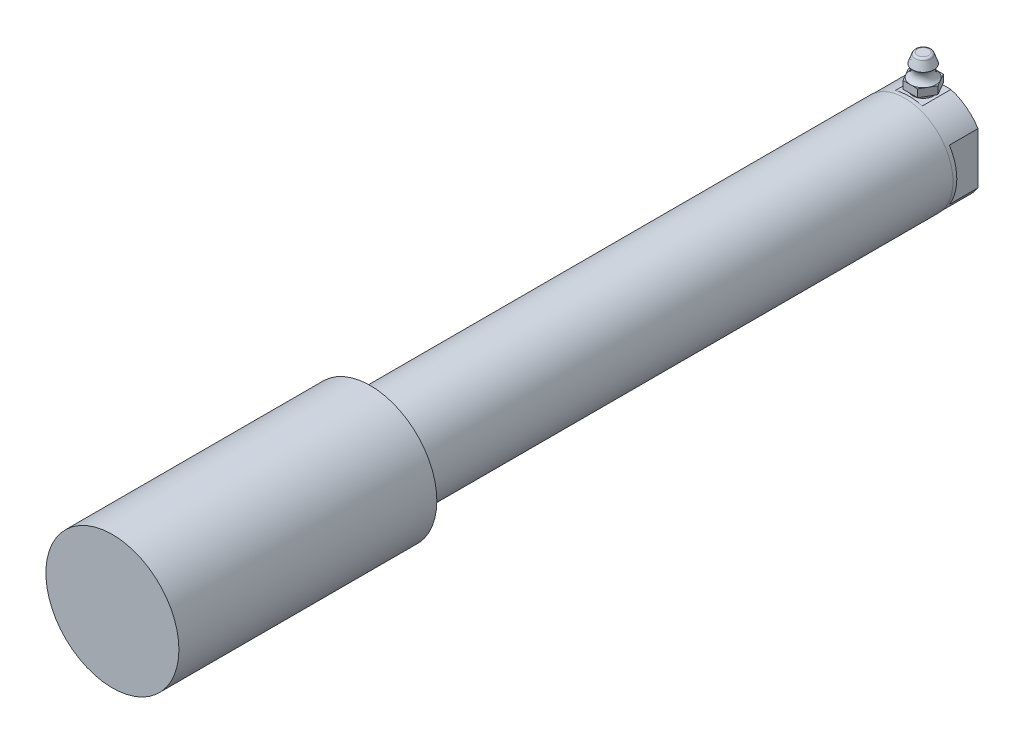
ISO-10303-21;
HEADER;
FILE_DESCRIPTION(('STEP AP214'),'2;1');
FILE_NAME('part.step','',(''),(''),'','','');
FILE_SCHEMA(('AUTOMOTIVE_DESIGN { 1 0 10303 214 1 1 1 1 }'));
ENDSEC;
DATA;
#1=APPLICATION_CONTEXT('core data for automotive mechanical design processes');
#2=APPLICATION_PROTOCOL_DEFINITION('international standard','automotive_design',2000,#1);
#3=PRODUCT_CONTEXT('',#1,'mechanical');
#4=PRODUCT('Part','Part','',(#3));
#5=PRODUCT_RELATED_PRODUCT_CATEGORY('part','',(#4));
#6=PRODUCT_DEFINITION_FORMATION('','',#4);
#7=PRODUCT_DEFINITION_CONTEXT('part definition',#1,'design');
#8=PRODUCT_DEFINITION('design','',#6,#7);
#9=PRODUCT_DEFINITION_SHAPE('','',#8);
#10=(LENGTH_UNIT() NAMED_UNIT(*) SI_UNIT(.MILLI.,.METRE.));
#11=(NAMED_UNIT(*) PLANE_ANGLE_UNIT() SI_UNIT($,.RADIAN.));
#12=(NAMED_UNIT(*) SI_UNIT($,.STERADIAN.) SOLID_ANGLE_UNIT());
#13=UNCERTAINTY_MEASURE_WITH_UNIT(LENGTH_MEASURE(1.E-05),#10,'distance_accuracy_value','');
#14=(GEOMETRIC_REPRESENTATION_CONTEXT(3) GLOBAL_UNCERTAINTY_ASSIGNED_CONTEXT((#13)) GLOBAL_UNIT_ASSIGNED_CONTEXT((#10,
#11,#12)) REPRESENTATION_CONTEXT('',''));
#15=CARTESIAN_POINT('',(0.,0.,0.));
#16=DIRECTION('',(0.,0.,1.));
#17=DIRECTION('',(1.,0.,0.));
#18=AXIS2_PLACEMENT_3D('',#15,#16,#17);
#19=CARTESIAN_POINT('',(0.,7.62,26.67));
#20=DIRECTION('',(0.,0.,-1.));
#21=DIRECTION('',(0.,1.,0.));
#22=AXIS2_PLACEMENT_3D('',#19,#20,#21);
#23=CYLINDRICAL_SURFACE('',#22,0.79375);
#24=CARTESIAN_POINT('',(0.,7.62,0.));
#25=DIRECTION('',(0.,0.,1.));
#26=DIRECTION('',(0.,-1.,0.));
#27=AXIS2_PLACEMENT_3D('',#24,#25,#26);
#28=CIRCLE('',#27,0.79375);
#29=CARTESIAN_POINT('',(0.,6.82625,0.));
#30=VERTEX_POINT('',#29);
#31=EDGE_CURVE('E205',#30,#30,#28,.T.);
#32=ORIENTED_EDGE('',*,*,#31,.F.);
#33=EDGE_LOOP('',(#32));
#34=FACE_BOUND('',#33,.T.);
#35=CARTESIAN_POINT('',(0.,7.62,0.619667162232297));
#36=DIRECTION('',(0.,0.,1.));
#37=DIRECTION('',(1.,0.,0.));
#38=AXIS2_PLACEMENT_3D('',#35,#36,#37);
#39=CIRCLE('',#38,0.79375);
#40=CARTESIAN_POINT('',(0.793749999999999,7.62,0.619667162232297));
#41=VERTEX_POINT('',#40);
#42=EDGE_CURVE('E10',#41,#41,#39,.F.);
#43=ORIENTED_EDGE('',*,*,#42,.F.);
#44=EDGE_LOOP('',(#43));
#45=FACE_BOUND('',#44,.T.);
#46=ADVANCED_FACE('F17',(#34,#45),#23,.F.);
#47=CARTESIAN_POINT('',(0.,0.,0.));
#48=DIRECTION('',(0.,0.,-1.));
#49=DIRECTION('',(0.,1.,0.));
#50=AXIS2_PLACEMENT_3D('',#47,#48,#49);
#51=CYLINDRICAL_SURFACE('',#50,4.96062);
#52=CARTESIAN_POINT('',(0.,0.,29.21));
#53=DIRECTION('',(0.,0.,-1.));
#54=DIRECTION('',(0.,1.,0.));
#55=AXIS2_PLACEMENT_3D('',#52,#53,#54);
#56=CIRCLE('',#55,4.96062);
#57=CARTESIAN_POINT('',(0.,4.96062,29.21));
#58=VERTEX_POINT('',#57);
#59=EDGE_CURVE('E191',#58,#58,#56,.T.);
#60=ORIENTED_EDGE('',*,*,#59,.F.);
#61=EDGE_LOOP('',(#60));
#62=FACE_BOUND('',#61,.T.);
#63=CARTESIAN_POINT('',(0.,0.,0.));
#64=DIRECTION('',(0.,0.,-1.));
#65=DIRECTION('',(0.,1.,0.));
#66=AXIS2_PLACEMENT_3D('',#63,#64,#65);
#67=CIRCLE('',#66,4.96062);
#68=CARTESIAN_POINT('',(0.,4.96062,0.));
#69=VERTEX_POINT('',#68);
#70=EDGE_CURVE('E185',#69,#69,#67,.T.);
#71=ORIENTED_EDGE('',*,*,#70,.T.);
#72=EDGE_LOOP('',(#71));
#73=FACE_BOUND('',#72,.T.);
#74=ADVANCED_FACE('F402',(#62,#73),#51,.F.);
#75=CARTESIAN_POINT('',(0.,0.,29.21));
#76=DIRECTION('',(0.,0.,-1.));
#77=DIRECTION('',(0.,1.,0.));
#78=AXIS2_PLACEMENT_3D('',#75,#76,#77);
#79=CONICAL_SURFACE('',#78,4.96062,1.02974425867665);
#80=CARTESIAN_POINT('',(0.,0.,32.1906412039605));
#81=VERTEX_POINT('',#80);
#82=VERTEX_LOOP('',#81);
#83=FACE_BOUND('',#82,.T.);
#84=ORIENTED_EDGE('',*,*,#59,.T.);
#85=EDGE_LOOP('',(#84));
#86=FACE_BOUND('',#85,.T.);
#87=ADVANCED_FACE('F410',(#83,#86),#79,.F.);
#88=CARTESIAN_POINT('',(0.,0.,255.999400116));
#89=DIRECTION('',(0.,0.,1.));
#90=DIRECTION('',(1.,0.,0.));
#91=AXIS2_PLACEMENT_3D('',#88,#89,#90);
#92=PLANE('',#91);
#93=CARTESIAN_POINT('',(0.,0.,255.999400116));
#94=DIRECTION('',(0.,0.,1.));
#95=DIRECTION('',(1.,0.,0.));
#96=AXIS2_PLACEMENT_3D('',#93,#94,#95);
#97=CIRCLE('',#96,20.6375);
#98=CARTESIAN_POINT('',(20.6375,0.,255.999400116));
#99=VERTEX_POINT('',#98);
#100=EDGE_CURVE('E227',#99,#99,#97,.T.);
#101=ORIENTED_EDGE('',*,*,#100,.T.);
#102=EDGE_LOOP('',(#101));
#103=FACE_BOUND('',#102,.T.);
#104=ADVANCED_FACE('F444',(#103),#92,.T.);
#105=CARTESIAN_POINT('',(0.,0.,255.999400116));
#106=DIRECTION('',(0.,0.,-1.));
#107=DIRECTION('',(-1.,0.,0.));
#108=AXIS2_PLACEMENT_3D('',#105,#106,#107);
#109=CYLINDRICAL_SURFACE('',#108,20.6375);
#110=ORIENTED_EDGE('',*,*,#100,.F.);
#111=EDGE_LOOP('',(#110));
#112=FACE_BOUND('',#111,.T.);
#113=CARTESIAN_POINT('',(0.,0.,175.9712));
#114=DIRECTION('',(0.,0.,1.));
#115=DIRECTION('',(1.,0.,0.));
#116=AXIS2_PLACEMENT_3D('',#113,#114,#115);
#117=CIRCLE('',#116,20.6375);
#118=CARTESIAN_POINT('',(20.6375,0.,175.9712));
#119=VERTEX_POINT('',#118);
#120=EDGE_CURVE('E231',#119,#119,#117,.T.);
#121=ORIENTED_EDGE('',*,*,#120,.T.);
#122=EDGE_LOOP('',(#121));
#123=FACE_BOUND('',#122,.T.);
#124=ADVANCED_FACE('F438',(#112,#123),#109,.T.);
#125=CARTESIAN_POINT('',(0.,0.,175.9712));
#126=DIRECTION('',(0.,0.,1.));
#127=DIRECTION('',(1.,0.,0.));
#128=AXIS2_PLACEMENT_3D('',#125,#126,#127);
#129=PLANE('',#128);
#130=CARTESIAN_POINT('',(0.,0.,175.9712));
#131=DIRECTION('',(0.,0.,1.));
#132=DIRECTION('',(1.,0.,0.));
#133=AXIS2_PLACEMENT_3D('',#130,#131,#132);
#134=CIRCLE('',#133,14.97203);
#135=CARTESIAN_POINT('',(14.97203,0.,175.9712));
#136=VERTEX_POINT('',#135);
#137=EDGE_CURVE('E230',#136,#136,#134,.F.);
#138=ORIENTED_EDGE('',*,*,#137,.F.);
#139=EDGE_LOOP('',(#138));
#140=FACE_BOUND('',#139,.T.);
#141=ORIENTED_EDGE('',*,*,#120,.F.);
#142=EDGE_LOOP('',(#141));
#143=FACE_BOUND('',#142,.T.);
#144=ADVANCED_FACE('F428',(#140,#143),#129,.F.);
#145=CARTESIAN_POINT('',(0.,0.,175.9712));
#146=DIRECTION('',(0.,0.,-1.));
#147=DIRECTION('',(-1.,0.,0.));
#148=AXIS2_PLACEMENT_3D('',#145,#146,#147);
#149=CYLINDRICAL_SURFACE('',#148,14.97203);
#150=CARTESIAN_POINT('',(0.,0.,10.16));
#151=DIRECTION('',(0.,0.,-1.));
#152=DIRECTION('',(-1.,0.,0.));
#153=AXIS2_PLACEMENT_3D('',#150,#151,#152);
#154=CIRCLE('',#153,14.97203);
#155=CARTESIAN_POINT('',(-14.97203,0.,10.16));
#156=VERTEX_POINT('',#155);
#157=EDGE_CURVE('E208',#156,#156,#154,.T.);
#158=ORIENTED_EDGE('',*,*,#157,.F.);
#159=EDGE_LOOP('',(#158));
#160=FACE_BOUND('',#159,.T.);
#161=ORIENTED_EDGE('',*,*,#137,.T.);
#162=EDGE_LOOP('',(#161));
#163=FACE_BOUND('',#162,.T.);
#164=ADVANCED_FACE('F425',(#160,#163),#149,.T.);
#165=CARTESIAN_POINT('',(0.,0.,10.16));
#166=DIRECTION('',(0.,0.,-1.));
#167=DIRECTION('',(-1.,0.,0.));
#168=AXIS2_PLACEMENT_3D('',#165,#166,#167);
#169=PLANE('',#168);
#170=ORIENTED_EDGE('',*,*,#157,.T.);
#171=EDGE_LOOP('',(#170));
#172=FACE_BOUND('',#171,.T.);
#173=CARTESIAN_POINT('',(0.,0.,10.16));
#174=DIRECTION('',(0.,0.,1.));
#175=DIRECTION('',(0.,-1.,0.));
#176=AXIS2_PLACEMENT_3D('',#173,#174,#175);
#177=CIRCLE('',#176,14.8844);
#178=CARTESIAN_POINT('',(0.,-14.8844,10.16));
#179=VERTEX_POINT('',#178);
#180=EDGE_CURVE('E150',#179,#179,#177,.T.);
#181=ORIENTED_EDGE('',*,*,#180,.T.);
#182=EDGE_LOOP('',(#181));
#183=FACE_BOUND('',#182,.T.);
#184=ADVANCED_FACE('F405',(#172,#183),#169,.T.);
#185=CARTESIAN_POINT('',(-1.14585258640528E-13,24.4475,4.44500000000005));
#186=DIRECTION('',(0.,1.,0.));
#187=DIRECTION('',(0.,0.,1.));
#188=AXIS2_PLACEMENT_3D('',#185,#186,#187);
#189=PLANE('',#188);
#190=CARTESIAN_POINT('',(-1.14585258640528E-13,24.4475,4.44500000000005));
#191=DIRECTION('',(0.,1.,0.));
#192=DIRECTION('',(0.,0.,1.));
#193=AXIS2_PLACEMENT_3D('',#190,#191,#192);
#194=CIRCLE('',#193,1.7474960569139);
#195=CARTESIAN_POINT('',(-1.14585258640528E-13,24.4475,6.19249605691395));
#196=VERTEX_POINT('',#195);
#197=EDGE_CURVE('E234',#196,#196,#194,.T.);
#198=ORIENTED_EDGE('',*,*,#197,.T.);
#199=EDGE_LOOP('',(#198));
#200=FACE_BOUND('',#199,.T.);
#201=ADVANCED_FACE('F307',(#200),#189,.T.);
#202=CARTESIAN_POINT('',(-1.14559021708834E-13,23.6855,4.44500000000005));
#203=DIRECTION('',(0.,1.,0.));
#204=DIRECTION('',(0.,0.,1.));
#205=AXIS2_PLACEMENT_3D('',#202,#203,#204);
#206=TOROIDAL_SURFACE('',#205,1.7474960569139,0.762);
#207=ORIENTED_EDGE('',*,*,#197,.F.);
#208=EDGE_LOOP('',(#207));
#209=FACE_BOUND('',#208,.T.);
#210=CARTESIAN_POINT('',(-1.14567780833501E-13,23.9398915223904,4.44500000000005));
#211=DIRECTION('',(0.,1.,0.));
#212=DIRECTION('',(0.,0.,1.));
#213=AXIS2_PLACEMENT_3D('',#210,#211,#212);
#214=CIRCLE('',#213,2.46577800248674);
#215=CARTESIAN_POINT('',(-1.14567780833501E-13,23.9398915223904,6.9107780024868));
#216=VERTEX_POINT('',#215);
#217=EDGE_CURVE('E302',#216,#216,#214,.F.);
#218=ORIENTED_EDGE('',*,*,#217,.F.);
#219=EDGE_LOOP('',(#218));
#220=FACE_BOUND('',#219,.T.);
#221=ADVANCED_FACE('F19',(#209,#220),#206,.T.);
#222=CARTESIAN_POINT('',(-1.14480310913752E-13,21.3995,4.44500000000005));
#223=DIRECTION('',(0.,-1.,0.));
#224=DIRECTION('',(0.,0.,-1.));
#225=AXIS2_PLACEMENT_3D('',#222,#223,#224);
#226=CONICAL_SURFACE('',#225,3.3655,0.340381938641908);
#227=ORIENTED_EDGE('',*,*,#217,.T.);
#228=EDGE_LOOP('',(#227));
#229=FACE_BOUND('',#228,.T.);
#230=CARTESIAN_POINT('',(-1.14480310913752E-13,21.3995,4.44500000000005));
#231=DIRECTION('',(0.,-1.,0.));
#232=DIRECTION('',(0.,0.,-1.));
#233=AXIS2_PLACEMENT_3D('',#230,#231,#232);
#234=CIRCLE('',#233,3.3655);
#235=CARTESIAN_POINT('',(-1.14480310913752E-13,21.3995,1.07950000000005));
#236=VERTEX_POINT('',#235);
#237=EDGE_CURVE('E239',#236,#236,#234,.T.);
#238=ORIENTED_EDGE('',*,*,#237,.F.);
#239=EDGE_LOOP('',(#238));
#240=FACE_BOUND('',#239,.T.);
#241=ADVANCED_FACE('F311',(#229,#240),#226,.T.);
#242=CARTESIAN_POINT('',(-1.14425278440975E-13,19.8011902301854,4.44500000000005));
#243=DIRECTION('',(0.,-1.,0.));
#244=DIRECTION('',(0.,0.,-1.));
#245=AXIS2_PLACEMENT_3D('',#242,#243,#244);
#246=TOROIDAL_SURFACE('',#245,5.20693450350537,2.43833450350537);
#247=ORIENTED_EDGE('',*,*,#237,.T.);
#248=EDGE_LOOP('',(#247));
#249=FACE_BOUND('',#248,.T.);
#250=CARTESIAN_POINT('',(-1.14352952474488E-13,17.700625,4.44500000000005));
#251=DIRECTION('',(0.,-1.,0.));
#252=DIRECTION('',(0.,0.,-1.));
#253=AXIS2_PLACEMENT_3D('',#250,#251,#252);
#254=CIRCLE('',#253,3.96875);
#255=CARTESIAN_POINT('',(-1.14352952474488E-13,17.700625,0.476250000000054));
#256=VERTEX_POINT('',#255);
#257=CARTESIAN_POINT('',(3.43703832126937,17.700625,2.46062500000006));
#258=VERTEX_POINT('',#257);
#259=EDGE_CURVE('E103',#256,#258,#254,.T.);
#260=ORIENTED_EDGE('',*,*,#259,.F.);
#261=CARTESIAN_POINT('',(-3.4370383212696,17.700625,2.46062500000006));
#262=VERTEX_POINT('',#261);
#263=EDGE_CURVE('E242',#262,#256,#254,.T.);
#264=ORIENTED_EDGE('',*,*,#263,.F.);
#265=CARTESIAN_POINT('',(-3.4370383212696,17.700625,6.429375));
#266=VERTEX_POINT('',#265);
#267=EDGE_CURVE('E333',#266,#262,#254,.T.);
#268=ORIENTED_EDGE('',*,*,#267,.F.);
#269=CARTESIAN_POINT('',(-1.1360179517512E-13,17.700625,8.41375));
#270=VERTEX_POINT('',#269);
#271=EDGE_CURVE('E329',#270,#266,#254,.T.);
#272=ORIENTED_EDGE('',*,*,#271,.F.);
#273=CARTESIAN_POINT('',(3.43703832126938,17.700625,6.429375));
#274=VERTEX_POINT('',#273);
#275=EDGE_CURVE('E328',#274,#270,#254,.T.);
#276=ORIENTED_EDGE('',*,*,#275,.F.);
#277=EDGE_CURVE('E96',#258,#274,#254,.T.);
#278=ORIENTED_EDGE('',*,*,#277,.F.);
#279=EDGE_LOOP('',(#260,#264,#268,#272,#276,#278));
#280=FACE_BOUND('',#279,.T.);
#281=ADVANCED_FACE('F316',(#249,#280),#246,.F.);
#282=CARTESIAN_POINT('',(-2.29135888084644,17.700625,0.476250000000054));
#283=DIRECTION('',(0.,1.,0.));
#284=DIRECTION('',(1.,0.,0.));
#285=AXIS2_PLACEMENT_3D('',#282,#283,#284);
#286=PLANE('',#285);
#287=ORIENTED_EDGE('',*,*,#267,.T.);
#288=DIRECTION('',(-0.5,0.,0.866025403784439));
#289=VECTOR('',#288,1.);
#290=CARTESIAN_POINT('',(-2.29135888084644,17.700625,0.476250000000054));
#291=LINE('',#290,#289);
#292=CARTESIAN_POINT('',(-4.58271776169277,17.700625,4.44500000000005));
#293=VERTEX_POINT('',#292);
#294=EDGE_CURVE('E253',#262,#293,#291,.T.);
#295=ORIENTED_EDGE('',*,*,#294,.T.);
#296=DIRECTION('',(0.5,0.,0.866025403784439));
#297=VECTOR('',#296,1.);
#298=CARTESIAN_POINT('',(-4.58271776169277,17.700625,4.44500000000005));
#299=LINE('',#298,#297);
#300=EDGE_CURVE('E259',#293,#266,#299,.T.);
#301=ORIENTED_EDGE('',*,*,#300,.T.);
#302=EDGE_LOOP('',(#287,#295,#301));
#303=FACE_BOUND('',#302,.T.);
#304=ADVANCED_FACE('F322',(#303),#286,.T.);
#305=ORIENTED_EDGE('',*,*,#271,.T.);
#306=CARTESIAN_POINT('',(-2.29135888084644,17.700625,8.41375));
#307=VERTEX_POINT('',#306);
#308=EDGE_CURVE('E258',#266,#307,#299,.T.);
#309=ORIENTED_EDGE('',*,*,#308,.T.);
#310=DIRECTION('',(1.,0.,0.));
#311=VECTOR('',#310,1.);
#312=CARTESIAN_POINT('',(-2.29135888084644,17.700625,8.41375));
#313=LINE('',#312,#311);
#314=EDGE_CURVE('E262',#307,#270,#313,.T.);
#315=ORIENTED_EDGE('',*,*,#314,.T.);
#316=EDGE_LOOP('',(#305,#309,#315));
#317=FACE_BOUND('',#316,.T.);
#318=ADVANCED_FACE('F366',(#317),#286,.T.);
#319=ORIENTED_EDGE('',*,*,#275,.T.);
#320=CARTESIAN_POINT('',(2.29135888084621,17.700625,8.41375));
#321=VERTEX_POINT('',#320);
#322=EDGE_CURVE('E261',#270,#321,#313,.T.);
#323=ORIENTED_EDGE('',*,*,#322,.T.);
#324=DIRECTION('',(0.5,0.,-0.866025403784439));
#325=VECTOR('',#324,1.);
#326=CARTESIAN_POINT('',(2.29135888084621,17.700625,8.41375));
#327=LINE('',#326,#325);
#328=EDGE_CURVE('E266',#321,#274,#327,.T.);
#329=ORIENTED_EDGE('',*,*,#328,.T.);
#330=EDGE_LOOP('',(#319,#323,#329));
#331=FACE_BOUND('',#330,.T.);
#332=ADVANCED_FACE('F371',(#331),#286,.T.);
#333=ORIENTED_EDGE('',*,*,#277,.T.);
#334=CARTESIAN_POINT('',(4.58271776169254,17.700625,4.44500000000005));
#335=VERTEX_POINT('',#334);
#336=EDGE_CURVE('E265',#274,#335,#327,.T.);
#337=ORIENTED_EDGE('',*,*,#336,.T.);
#338=DIRECTION('',(-0.5,0.,-0.866025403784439));
#339=VECTOR('',#338,1.);
#340=CARTESIAN_POINT('',(4.58271776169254,17.700625,4.44500000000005));
#341=LINE('',#340,#339);
#342=EDGE_CURVE('E270',#335,#258,#341,.T.);
#343=ORIENTED_EDGE('',*,*,#342,.T.);
#344=EDGE_LOOP('',(#333,#337,#343));
#345=FACE_BOUND('',#344,.T.);
#346=ADVANCED_FACE('F375',(#345),#286,.T.);
#347=ORIENTED_EDGE('',*,*,#259,.T.);
#348=CARTESIAN_POINT('',(2.29135888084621,17.700625,0.476250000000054));
#349=VERTEX_POINT('',#348);
#350=EDGE_CURVE('E269',#258,#349,#341,.T.);
#351=ORIENTED_EDGE('',*,*,#350,.T.);
#352=DIRECTION('',(-1.,0.,0.));
#353=VECTOR('',#352,1.);
#354=CARTESIAN_POINT('',(2.29135888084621,17.700625,0.476250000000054));
#355=LINE('',#354,#353);
#356=EDGE_CURVE('E251',#349,#256,#355,.T.);
#357=ORIENTED_EDGE('',*,*,#356,.T.);
#358=EDGE_LOOP('',(#347,#351,#357));
#359=FACE_BOUND('',#358,.T.);
#360=ADVANCED_FACE('F345',(#359),#286,.T.);
#361=ORIENTED_EDGE('',*,*,#263,.T.);
#362=CARTESIAN_POINT('',(-2.29135888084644,17.700625,0.476250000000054));
#363=VERTEX_POINT('',#362);
#364=EDGE_CURVE('E254',#256,#363,#355,.T.);
#365=ORIENTED_EDGE('',*,*,#364,.T.);
#366=EDGE_CURVE('E255',#363,#262,#291,.T.);
#367=ORIENTED_EDGE('',*,*,#366,.T.);
#368=EDGE_LOOP('',(#361,#365,#367));
#369=FACE_BOUND('',#368,.T.);
#370=ADVANCED_FACE('F339',(#369),#286,.T.);
#371=CARTESIAN_POINT('',(-2.29135888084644,17.700625,0.476250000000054));
#372=DIRECTION('',(0.866025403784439,0.,0.5));
#373=DIRECTION('',(0.5,0.,-0.866025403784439));
#374=AXIS2_PLACEMENT_3D('',#371,#372,#373);
#375=PLANE('',#374);
#376=DIRECTION('',(-0.5,0.,0.866025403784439));
#377=VECTOR('',#376,1.);
#378=CARTESIAN_POINT('',(-2.29135888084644,15.319375,0.476250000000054));
#379=LINE('',#378,#377);
#380=CARTESIAN_POINT('',(-2.29135888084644,15.319375,0.476250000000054));
#381=VERTEX_POINT('',#380);
#382=CARTESIAN_POINT('',(-4.58271776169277,15.319375,4.44500000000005));
#383=VERTEX_POINT('',#382);
#384=EDGE_CURVE('E275',#381,#383,#379,.T.);
#385=ORIENTED_EDGE('',*,*,#384,.T.);
#386=DIRECTION('',(0.,-1.,0.));
#387=VECTOR('',#386,1.);
#388=CARTESIAN_POINT('',(-4.58271776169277,17.700625,4.44500000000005));
#389=LINE('',#388,#387);
#390=EDGE_CURVE('E296',#293,#383,#389,.T.);
#391=ORIENTED_EDGE('',*,*,#390,.F.);
#392=ORIENTED_EDGE('',*,*,#294,.F.);
#393=ORIENTED_EDGE('',*,*,#366,.F.);
#394=DIRECTION('',(0.,-1.,0.));
#395=VECTOR('',#394,1.);
#396=CARTESIAN_POINT('',(-2.29135888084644,17.700625,0.476250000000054));
#397=LINE('',#396,#395);
#398=EDGE_CURVE('E299',#363,#381,#397,.T.);
#399=ORIENTED_EDGE('',*,*,#398,.T.);
#400=EDGE_LOOP('',(#385,#391,#392,#393,#399));
#401=FACE_BOUND('',#400,.T.);
#402=ADVANCED_FACE('F359',(#401),#375,.F.);
#403=CARTESIAN_POINT('',(-4.58271776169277,17.700625,4.44500000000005));
#404=DIRECTION('',(0.866025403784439,0.,-0.5));
#405=DIRECTION('',(-0.5,0.,-0.866025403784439));
#406=AXIS2_PLACEMENT_3D('',#403,#404,#405);
#407=PLANE('',#406);
#408=DIRECTION('',(0.5,0.,0.866025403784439));
#409=VECTOR('',#408,1.);
#410=CARTESIAN_POINT('',(-4.58271776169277,15.319375,4.44500000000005));
#411=LINE('',#410,#409);
#412=CARTESIAN_POINT('',(-2.29135888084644,15.319375,8.41375));
#413=VERTEX_POINT('',#412);
#414=EDGE_CURVE('E277',#383,#413,#411,.T.);
#415=ORIENTED_EDGE('',*,*,#414,.T.);
#416=DIRECTION('',(0.,-1.,0.));
#417=VECTOR('',#416,1.);
#418=CARTESIAN_POINT('',(-2.29135888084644,17.700625,8.41375));
#419=LINE('',#418,#417);
#420=EDGE_CURVE('E293',#307,#413,#419,.T.);
#421=ORIENTED_EDGE('',*,*,#420,.F.);
#422=ORIENTED_EDGE('',*,*,#308,.F.);
#423=ORIENTED_EDGE('',*,*,#300,.F.);
#424=ORIENTED_EDGE('',*,*,#390,.T.);
#425=EDGE_LOOP('',(#415,#421,#422,#423,#424));
#426=FACE_BOUND('',#425,.T.);
#427=ADVANCED_FACE('F364',(#426),#407,.F.);
#428=CARTESIAN_POINT('',(-2.29135888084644,17.700625,8.41375));
#429=DIRECTION('',(0.,0.,-1.));
#430=DIRECTION('',(-1.,0.,0.));
#431=AXIS2_PLACEMENT_3D('',#428,#429,#430);
#432=PLANE('',#431);
#433=DIRECTION('',(1.,0.,0.));
#434=VECTOR('',#433,1.);
#435=CARTESIAN_POINT('',(-2.29135888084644,15.319375,8.41375));
#436=LINE('',#435,#434);
#437=CARTESIAN_POINT('',(2.29135888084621,15.319375,8.41375));
#438=VERTEX_POINT('',#437);
#439=EDGE_CURVE('E279',#413,#438,#436,.T.);
#440=ORIENTED_EDGE('',*,*,#439,.T.);
#441=DIRECTION('',(0.,-1.,0.));
#442=VECTOR('',#441,1.);
#443=CARTESIAN_POINT('',(2.29135888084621,17.700625,8.41375));
#444=LINE('',#443,#442);
#445=EDGE_CURVE('E290',#321,#438,#444,.T.);
#446=ORIENTED_EDGE('',*,*,#445,.F.);
#447=ORIENTED_EDGE('',*,*,#322,.F.);
#448=ORIENTED_EDGE('',*,*,#314,.F.);
#449=ORIENTED_EDGE('',*,*,#420,.T.);
#450=EDGE_LOOP('',(#440,#446,#447,#448,#449));
#451=FACE_BOUND('',#450,.T.);
#452=ADVANCED_FACE('F368',(#451),#432,.F.);
#453=CARTESIAN_POINT('',(2.29135888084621,17.700625,8.41375));
#454=DIRECTION('',(-0.866025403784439,0.,-0.5));
#455=DIRECTION('',(-0.5,0.,0.866025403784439));
#456=AXIS2_PLACEMENT_3D('',#453,#454,#455);
#457=PLANE('',#456);
#458=DIRECTION('',(0.5,0.,-0.866025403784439));
#459=VECTOR('',#458,1.);
#460=CARTESIAN_POINT('',(2.29135888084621,15.319375,8.41375));
#461=LINE('',#460,#459);
#462=CARTESIAN_POINT('',(4.58271776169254,15.319375,4.44500000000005));
#463=VERTEX_POINT('',#462);
#464=EDGE_CURVE('E281',#438,#463,#461,.T.);
#465=ORIENTED_EDGE('',*,*,#464,.T.);
#466=DIRECTION('',(0.,-1.,0.));
#467=VECTOR('',#466,1.);
#468=CARTESIAN_POINT('',(4.58271776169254,17.700625,4.44500000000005));
#469=LINE('',#468,#467);
#470=EDGE_CURVE('E287',#335,#463,#469,.T.);
#471=ORIENTED_EDGE('',*,*,#470,.F.);
#472=ORIENTED_EDGE('',*,*,#336,.F.);
#473=ORIENTED_EDGE('',*,*,#328,.F.);
#474=ORIENTED_EDGE('',*,*,#445,.T.);
#475=EDGE_LOOP('',(#465,#471,#472,#473,#474));
#476=FACE_BOUND('',#475,.T.);
#477=ADVANCED_FACE('F373',(#476),#457,.F.);
#478=CARTESIAN_POINT('',(4.58271776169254,17.700625,4.44500000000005));
#479=DIRECTION('',(-0.866025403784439,0.,0.5));
#480=DIRECTION('',(0.5,0.,0.866025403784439));
#481=AXIS2_PLACEMENT_3D('',#478,#479,#480);
#482=PLANE('',#481);
#483=DIRECTION('',(-0.5,0.,-0.866025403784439));
#484=VECTOR('',#483,1.);
#485=CARTESIAN_POINT('',(4.58271776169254,15.319375,4.44500000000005));
#486=LINE('',#485,#484);
#487=CARTESIAN_POINT('',(2.29135888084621,15.319375,0.476250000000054));
#488=VERTEX_POINT('',#487);
#489=EDGE_CURVE('E283',#463,#488,#486,.T.);
#490=ORIENTED_EDGE('',*,*,#489,.T.);
#491=DIRECTION('',(0.,-1.,0.));
#492=VECTOR('',#491,1.);
#493=CARTESIAN_POINT('',(2.29135888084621,17.700625,0.476250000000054));
#494=LINE('',#493,#492);
#495=EDGE_CURVE('E272',#349,#488,#494,.T.);
#496=ORIENTED_EDGE('',*,*,#495,.F.);
#497=ORIENTED_EDGE('',*,*,#350,.F.);
#498=ORIENTED_EDGE('',*,*,#342,.F.);
#499=ORIENTED_EDGE('',*,*,#470,.T.);
#500=EDGE_LOOP('',(#490,#496,#497,#498,#499));
#501=FACE_BOUND('',#500,.T.);
#502=ADVANCED_FACE('F349',(#501),#482,.F.);
#503=CARTESIAN_POINT('',(2.29135888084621,17.700625,0.476250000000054));
#504=DIRECTION('',(0.,0.,1.));
#505=DIRECTION('',(0.,-1.,0.));
#506=AXIS2_PLACEMENT_3D('',#503,#504,#505);
#507=PLANE('',#506);
#508=DIRECTION('',(-1.,0.,0.));
#509=VECTOR('',#508,1.);
#510=CARTESIAN_POINT('',(2.29135888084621,15.319375,0.476250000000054));
#511=LINE('',#510,#509);
#512=EDGE_CURVE('E250',#488,#381,#511,.T.);
#513=ORIENTED_EDGE('',*,*,#512,.T.);
#514=ORIENTED_EDGE('',*,*,#398,.F.);
#515=ORIENTED_EDGE('',*,*,#364,.F.);
#516=ORIENTED_EDGE('',*,*,#356,.F.);
#517=ORIENTED_EDGE('',*,*,#495,.T.);
#518=EDGE_LOOP('',(#513,#514,#515,#516,#517));
#519=FACE_BOUND('',#518,.T.);
#520=ADVANCED_FACE('F344',(#519),#507,.F.);
#521=CARTESIAN_POINT('',(-2.29135888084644,15.319375,0.476250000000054));
#522=DIRECTION('',(0.,1.,0.));
#523=DIRECTION('',(1.,0.,0.));
#524=AXIS2_PLACEMENT_3D('',#521,#522,#523);
#525=PLANE('',#524);
#526=CARTESIAN_POINT('',(-1.14270962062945E-13,15.319375,4.44500000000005));
#527=DIRECTION('',(0.,-1.,0.));
#528=DIRECTION('',(0.,0.,-1.));
#529=AXIS2_PLACEMENT_3D('',#526,#527,#528);
#530=CIRCLE('',#529,3.2385);
#531=CARTESIAN_POINT('',(-1.14270962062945E-13,15.319375,1.20650000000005));
#532=VERTEX_POINT('',#531);
#533=EDGE_CURVE('E244',#532,#532,#530,.T.);
#534=ORIENTED_EDGE('',*,*,#533,.F.);
#535=EDGE_LOOP('',(#534));
#536=FACE_BOUND('',#535,.T.);
#537=ORIENTED_EDGE('',*,*,#512,.F.);
#538=ORIENTED_EDGE('',*,*,#489,.F.);
#539=ORIENTED_EDGE('',*,*,#464,.F.);
#540=ORIENTED_EDGE('',*,*,#439,.F.);
#541=ORIENTED_EDGE('',*,*,#414,.F.);
#542=ORIENTED_EDGE('',*,*,#384,.F.);
#543=EDGE_LOOP('',(#537,#538,#539,#540,#541,#542));
#544=FACE_BOUND('',#543,.T.);
#545=ADVANCED_FACE('F353',(#536,#544),#525,.F.);
#546=CARTESIAN_POINT('',(-1.14270962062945E-13,15.319375,4.44500000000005));
#547=DIRECTION('',(0.,-1.,0.));
#548=DIRECTION('',(0.,0.,-1.));
#549=AXIS2_PLACEMENT_3D('',#546,#547,#548);
#550=CYLINDRICAL_SURFACE('',#549,3.2385);
#551=ORIENTED_EDGE('',*,*,#533,.T.);
#552=EDGE_LOOP('',(#551));
#553=FACE_BOUND('',#552,.T.);
#554=CARTESIAN_POINT('',(-1.14253470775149E-13,14.811375,4.44500000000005));
#555=DIRECTION('',(0.,-1.,0.));
#556=DIRECTION('',(0.,0.,-1.));
#557=AXIS2_PLACEMENT_3D('',#554,#555,#556);
#558=CIRCLE('',#557,3.2385);
#559=CARTESIAN_POINT('',(-1.14253470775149E-13,14.811375,1.20650000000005));
#560=VERTEX_POINT('',#559);
#561=EDGE_CURVE('E247',#560,#560,#558,.T.);
#562=ORIENTED_EDGE('',*,*,#561,.F.);
#563=EDGE_LOOP('',(#562));
#564=FACE_BOUND('',#563,.T.);
#565=ADVANCED_FACE('F743',(#553,#564),#550,.T.);
#566=CARTESIAN_POINT('',(-1.14106981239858E-13,10.556875,4.44500000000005));
#567=DIRECTION('',(0.,1.,0.));
#568=DIRECTION('',(0.,0.,1.));
#569=AXIS2_PLACEMENT_3D('',#566,#567,#568);
#570=CONICAL_SURFACE('',#569,3.048,0.0447462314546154);
#571=ORIENTED_EDGE('',*,*,#561,.T.);
#572=EDGE_LOOP('',(#571));
#573=FACE_BOUND('',#572,.T.);
#574=CARTESIAN_POINT('',(-1.14210526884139E-13,14.2875,4.44500000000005));
#575=DIRECTION('',(0.,-1.,0.));
#576=DIRECTION('',(1.,0.,0.));
#577=AXIS2_PLACEMENT_3D('',#574,#575,#576);
#578=CIRCLE('',#577,3.21504291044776);
#579=CARTESIAN_POINT('',(3.21504291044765,14.2875,4.44500000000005));
#580=VERTEX_POINT('',#579);
#581=EDGE_CURVE('E218',#580,#580,#578,.T.);
#582=ORIENTED_EDGE('',*,*,#581,.F.);
#583=EDGE_LOOP('',(#582));
#584=FACE_BOUND('',#583,.T.);
#585=ADVANCED_FACE('F413',(#573,#584),#570,.T.);
#586=CARTESIAN_POINT('',(0.,0.,8.89));
#587=DIRECTION('',(0.,0.,-1.));
#588=DIRECTION('',(0.,1.,0.));
#589=AXIS2_PLACEMENT_3D('',#586,#587,#588);
#590=PLANE('',#589);
#591=DIRECTION('',(0.,-1.,0.));
#592=VECTOR('',#591,1.);
#593=CARTESIAN_POINT('',(12.573,-7.9664944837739,8.89));
#594=LINE('',#593,#592);
#595=CARTESIAN_POINT('',(12.573,7.9664944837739,8.89));
#596=VERTEX_POINT('',#595);
#597=CARTESIAN_POINT('',(12.573,-7.9664944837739,8.89));
#598=VERTEX_POINT('',#597);
#599=EDGE_CURVE('E146',#596,#598,#594,.T.);
#600=ORIENTED_EDGE('',*,*,#599,.F.);
#601=CARTESIAN_POINT('',(0.,0.,8.89));
#602=DIRECTION('',(0.,0.,-1.));
#603=DIRECTION('',(0.,1.,0.));
#604=AXIS2_PLACEMENT_3D('',#601,#602,#603);
#605=CIRCLE('',#604,14.8844);
#606=EDGE_CURVE('E169',#598,#596,#605,.F.);
#607=ORIENTED_EDGE('',*,*,#606,.F.);
#608=EDGE_LOOP('',(#600,#607));
#609=FACE_BOUND('',#608,.T.);
#610=ADVANCED_FACE('F437',(#609),#590,.T.);
#611=CARTESIAN_POINT('',(12.573,-7.9664944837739,8.89));
#612=DIRECTION('',(1.,0.,0.));
#613=DIRECTION('',(0.,0.,-1.));
#614=AXIS2_PLACEMENT_3D('',#611,#612,#613);
#615=PLANE('',#614);
#616=DIRECTION('',(0.,-1.,0.));
#617=VECTOR('',#616,1.);
#618=CARTESIAN_POINT('',(12.573,-7.9664944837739,0.));
#619=LINE('',#618,#617);
#620=CARTESIAN_POINT('',(12.573,7.9664944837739,0.));
#621=VERTEX_POINT('',#620);
#622=CARTESIAN_POINT('',(12.573,-7.9664944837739,0.));
#623=VERTEX_POINT('',#622);
#624=EDGE_CURVE('E143',#621,#623,#619,.T.);
#625=ORIENTED_EDGE('',*,*,#624,.F.);
#626=DIRECTION('',(0.,0.,-1.));
#627=VECTOR('',#626,1.);
#628=CARTESIAN_POINT('',(12.573,7.9664944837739,8.89));
#629=LINE('',#628,#627);
#630=EDGE_CURVE('E151',#596,#621,#629,.T.);
#631=ORIENTED_EDGE('',*,*,#630,.F.);
#632=ORIENTED_EDGE('',*,*,#599,.T.);
#633=DIRECTION('',(0.,0.,-1.));
#634=VECTOR('',#633,1.);
#635=CARTESIAN_POINT('',(12.573,-7.9664944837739,8.89));
#636=LINE('',#635,#634);
#637=EDGE_CURVE('E140',#598,#623,#636,.T.);
#638=ORIENTED_EDGE('',*,*,#637,.T.);
#639=EDGE_LOOP('',(#625,#631,#632,#638));
#640=FACE_BOUND('',#639,.T.);
#641=ADVANCED_FACE('F142',(#640),#615,.T.);
#642=DIRECTION('',(0.,1.,0.));
#643=VECTOR('',#642,1.);
#644=CARTESIAN_POINT('',(-12.573,-7.9664944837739,8.89));
#645=LINE('',#644,#643);
#646=CARTESIAN_POINT('',(-12.573,-7.9664944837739,8.89));
#647=VERTEX_POINT('',#646);
#648=CARTESIAN_POINT('',(-12.573,7.9664944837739,8.89));
#649=VERTEX_POINT('',#648);
#650=EDGE_CURVE('E161',#647,#649,#645,.T.);
#651=ORIENTED_EDGE('',*,*,#650,.F.);
#652=EDGE_CURVE('E172',#649,#647,#605,.F.);
#653=ORIENTED_EDGE('',*,*,#652,.F.);
#654=EDGE_LOOP('',(#651,#653));
#655=FACE_BOUND('',#654,.T.);
#656=ADVANCED_FACE('F470',(#655),#590,.T.);
#657=CARTESIAN_POINT('',(-12.573,-7.9664944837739,8.89));
#658=DIRECTION('',(-1.,0.,0.));
#659=DIRECTION('',(0.,0.,1.));
#660=AXIS2_PLACEMENT_3D('',#657,#658,#659);
#661=PLANE('',#660);
#662=DIRECTION('',(0.,1.,0.));
#663=VECTOR('',#662,1.);
#664=CARTESIAN_POINT('',(-12.573,-7.9664944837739,0.));
#665=LINE('',#664,#663);
#666=CARTESIAN_POINT('',(-12.573,-7.9664944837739,0.));
#667=VERTEX_POINT('',#666);
#668=CARTESIAN_POINT('',(-12.573,7.9664944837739,0.));
#669=VERTEX_POINT('',#668);
#670=EDGE_CURVE('E162',#667,#669,#665,.T.);
#671=ORIENTED_EDGE('',*,*,#670,.F.);
#672=DIRECTION('',(0.,0.,-1.));
#673=VECTOR('',#672,1.);
#674=CARTESIAN_POINT('',(-12.573,-7.9664944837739,8.89));
#675=LINE('',#674,#673);
#676=EDGE_CURVE('E168',#647,#667,#675,.T.);
#677=ORIENTED_EDGE('',*,*,#676,.F.);
#678=ORIENTED_EDGE('',*,*,#650,.T.);
#679=DIRECTION('',(0.,0.,-1.));
#680=VECTOR('',#679,1.);
#681=CARTESIAN_POINT('',(-12.573,7.9664944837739,8.89));
#682=LINE('',#681,#680);
#683=EDGE_CURVE('E181',#649,#669,#682,.T.);
#684=ORIENTED_EDGE('',*,*,#683,.T.);
#685=EDGE_LOOP('',(#671,#677,#678,#684));
#686=FACE_BOUND('',#685,.T.);
#687=ADVANCED_FACE('F465',(#686),#661,.T.);
#688=CARTESIAN_POINT('',(0.,0.,0.));
#689=DIRECTION('',(0.,0.,-1.));
#690=DIRECTION('',(0.,1.,0.));
#691=AXIS2_PLACEMENT_3D('',#688,#689,#690);
#692=PLANE('',#691);
#693=ORIENTED_EDGE('',*,*,#70,.F.);
#694=EDGE_LOOP('',(#693));
#695=FACE_BOUND('',#694,.T.);
#696=DIRECTION('',(-1.,0.,0.));
#697=VECTOR('',#696,1.);
#698=CARTESIAN_POINT('',(4.17285359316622,14.2875,0.));
#699=LINE('',#698,#697);
#700=CARTESIAN_POINT('',(4.17285359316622,14.2875,0.));
#701=VERTEX_POINT('',#700);
#702=CARTESIAN_POINT('',(-4.17285359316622,14.2875,0.));
#703=VERTEX_POINT('',#702);
#704=EDGE_CURVE('E108',#701,#703,#699,.T.);
#705=ORIENTED_EDGE('',*,*,#704,.F.);
#706=CARTESIAN_POINT('',(0.,0.,0.));
#707=DIRECTION('',(0.,0.,-1.));
#708=DIRECTION('',(0.,1.,0.));
#709=AXIS2_PLACEMENT_3D('',#706,#707,#708);
#710=CIRCLE('',#709,14.8844);
#711=EDGE_CURVE('E160',#701,#621,#710,.T.);
#712=ORIENTED_EDGE('',*,*,#711,.T.);
#713=ORIENTED_EDGE('',*,*,#624,.T.);
#714=EDGE_CURVE('E158',#623,#667,#710,.T.);
#715=ORIENTED_EDGE('',*,*,#714,.T.);
#716=ORIENTED_EDGE('',*,*,#670,.T.);
#717=EDGE_CURVE('E170',#669,#703,#710,.T.);
#718=ORIENTED_EDGE('',*,*,#717,.T.);
#719=EDGE_LOOP('',(#705,#712,#713,#715,#716,#718));
#720=FACE_BOUND('',#719,.T.);
#721=ORIENTED_EDGE('',*,*,#31,.T.);
#722=EDGE_LOOP('',(#721));
#723=FACE_BOUND('',#722,.T.);
#724=ADVANCED_FACE('F155',(#695,#720,#723),#692,.T.);
#725=CARTESIAN_POINT('',(-4.17285359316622,14.2875,8.89));
#726=DIRECTION('',(0.,0.,-1.));
#727=DIRECTION('',(0.,1.,0.));
#728=AXIS2_PLACEMENT_3D('',#725,#726,#727);
#729=PLANE('',#728);
#730=CARTESIAN_POINT('',(0.,0.,8.89));
#731=DIRECTION('',(0.,0.,-1.));
#732=DIRECTION('',(0.,1.,0.));
#733=AXIS2_PLACEMENT_3D('',#730,#731,#732);
#734=CIRCLE('',#733,14.8844);
#735=CARTESIAN_POINT('',(4.17285359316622,14.2875,8.89));
#736=VERTEX_POINT('',#735);
#737=CARTESIAN_POINT('',(-4.17285359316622,14.2875,8.89));
#738=VERTEX_POINT('',#737);
#739=EDGE_CURVE('E223',#736,#738,#734,.F.);
#740=ORIENTED_EDGE('',*,*,#739,.F.);
#741=DIRECTION('',(-1.,0.,0.));
#742=VECTOR('',#741,1.);
#743=CARTESIAN_POINT('',(4.17285359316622,14.2875,8.89));
#744=LINE('',#743,#742);
#745=EDGE_CURVE('E196',#736,#738,#744,.T.);
#746=ORIENTED_EDGE('',*,*,#745,.T.);
#747=EDGE_LOOP('',(#740,#746));
#748=FACE_BOUND('',#747,.T.);
#749=ADVANCED_FACE('F464',(#748),#729,.T.);
#750=CARTESIAN_POINT('',(4.17285359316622,14.2875,8.89));
#751=DIRECTION('',(0.,-1.,0.));
#752=DIRECTION('',(0.,0.,-1.));
#753=AXIS2_PLACEMENT_3D('',#750,#751,#752);
#754=PLANE('',#753);
#755=ORIENTED_EDGE('',*,*,#581,.T.);
#756=EDGE_LOOP('',(#755));
#757=FACE_BOUND('',#756,.T.);
#758=ORIENTED_EDGE('',*,*,#704,.T.);
#759=DIRECTION('',(0.,0.,-1.));
#760=VECTOR('',#759,1.);
#761=CARTESIAN_POINT('',(-4.17285359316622,14.2875,8.89));
#762=LINE('',#761,#760);
#763=EDGE_CURVE('E194',#738,#703,#762,.T.);
#764=ORIENTED_EDGE('',*,*,#763,.F.);
#765=ORIENTED_EDGE('',*,*,#745,.F.);
#766=DIRECTION('',(0.,0.,-1.));
#767=VECTOR('',#766,1.);
#768=CARTESIAN_POINT('',(4.17285359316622,14.2875,8.89));
#769=LINE('',#768,#767);
#770=EDGE_CURVE('E37',#736,#701,#769,.T.);
#771=ORIENTED_EDGE('',*,*,#770,.T.);
#772=EDGE_LOOP('',(#758,#764,#765,#771));
#773=FACE_BOUND('',#772,.T.);
#774=ADVANCED_FACE('F395',(#757,#773),#754,.F.);
#775=CARTESIAN_POINT('',(0.,0.,2.54));
#776=DIRECTION('',(0.,0.,-1.));
#777=DIRECTION('',(0.,1.,0.));
#778=AXIS2_PLACEMENT_3D('',#775,#776,#777);
#779=CYLINDRICAL_SURFACE('',#778,14.8844);
#780=ORIENTED_EDGE('',*,*,#770,.F.);
#781=ORIENTED_EDGE('',*,*,#739,.T.);
#782=ORIENTED_EDGE('',*,*,#763,.T.);
#783=ORIENTED_EDGE('',*,*,#717,.F.);
#784=ORIENTED_EDGE('',*,*,#683,.F.);
#785=ORIENTED_EDGE('',*,*,#652,.T.);
#786=ORIENTED_EDGE('',*,*,#676,.T.);
#787=ORIENTED_EDGE('',*,*,#714,.F.);
#788=ORIENTED_EDGE('',*,*,#637,.F.);
#789=ORIENTED_EDGE('',*,*,#606,.T.);
#790=ORIENTED_EDGE('',*,*,#630,.T.);
#791=ORIENTED_EDGE('',*,*,#711,.F.);
#792=EDGE_LOOP('',(#780,#781,#782,#783,#784,#785,#786,#787,#788,#789,#790,#791));
#793=FACE_BOUND('',#792,.T.);
#794=ORIENTED_EDGE('',*,*,#180,.F.);
#795=EDGE_LOOP('',(#794));
#796=FACE_BOUND('',#795,.T.);
#797=ADVANCED_FACE('F165',(#793,#796),#779,.T.);
#798=CARTESIAN_POINT('',(0.,7.62,0.888999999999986));
#799=DIRECTION('',(0.,1.,0.));
#800=DIRECTION('',(1.,0.,0.));
#801=AXIS2_PLACEMENT_3D('',#798,#799,#800);
#802=SPHERICAL_SURFACE('',#801,0.8382);
#803=CARTESIAN_POINT('',(0.,7.62,0.888999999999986));
#804=DIRECTION('',(0.,0.,1.));
#805=DIRECTION('',(1.,0.,0.));
#806=AXIS2_PLACEMENT_3D('',#803,#804,#805);
#807=SPHERICAL_SURFACE('',#806,0.8382);
#808=ORIENTED_EDGE('',*,*,#42,.T.);
#809=EDGE_LOOP('',(#808));
#810=FACE_BOUND('',#809,.T.);
#811=ADVANCED_FACE('F385',(#810),#807,.T.);
#812=CLOSED_SHELL('',(#46,#74,#87,#104,#124,#144,#164,#184,#201,#221,#241,#281,#304,#318,#332,
#346,#360,#370,#402,#427,#452,#477,#502,#520,#545,#565,#585,#610,#641,#656,#687,#724,#749,#774,
#797,#811));
#813=CARTESIAN_POINT('',(0.,7.62,0.888999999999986));
#814=DIRECTION('',(0.,0.,-1.));
#815=DIRECTION('',(-1.,0.,0.));
#816=AXIS2_PLACEMENT_3D('',#813,#814,#815);
#817=SPHERICAL_SURFACE('',#816,0.8382);
#818=CARTESIAN_POINT('',(0.,7.62,1.15833283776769));
#819=DIRECTION('',(0.,0.,-1.));
#820=DIRECTION('',(-1.,0.,0.));
#821=AXIS2_PLACEMENT_3D('',#818,#819,#820);
#822=CIRCLE('',#821,0.79375);
#823=CARTESIAN_POINT('',(-0.793750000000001,7.62,1.15833283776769));
#824=VERTEX_POINT('',#823);
#825=EDGE_CURVE('E28',#824,#824,#822,.F.);
#826=ORIENTED_EDGE('',*,*,#825,.T.);
#827=EDGE_LOOP('',(#826));
#828=FACE_BOUND('',#827,.T.);
#829=ADVANCED_FACE('F389',(#828),#817,.T.);
#830=CARTESIAN_POINT('',(0.,8.41375,1.7399));
#831=CARTESIAN_POINT('',(-0.0435881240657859,8.4137493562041,1.73990044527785));
#832=CARTESIAN_POINT('',(-0.0871827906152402,8.41014765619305,1.74096365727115));
#833=CARTESIAN_POINT('',(-0.17310538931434,8.39586840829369,1.74510128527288));
#834=CARTESIAN_POINT('',(-0.215432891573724,8.38518848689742,1.74817637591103));
#835=CARTESIAN_POINT('',(-0.297569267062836,8.35713805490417,1.75600030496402));
#836=CARTESIAN_POINT('',(-0.337381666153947,8.33977716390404,1.76074673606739));
#837=CARTESIAN_POINT('',(-0.413530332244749,8.29889628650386,1.77141832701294));
#838=CARTESIAN_POINT('',(-0.449866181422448,8.2753755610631,1.77734362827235));
#839=CARTESIAN_POINT('',(-0.51903272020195,8.222158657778,1.78992213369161));
#840=CARTESIAN_POINT('',(-0.551753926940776,8.19232359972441,1.79658976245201));
#841=CARTESIAN_POINT('',(-0.611807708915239,8.12762110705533,1.80981407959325));
#842=CARTESIAN_POINT('',(-0.639139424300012,8.09275287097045,1.81637075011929));
#843=CARTESIAN_POINT('',(-0.688205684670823,8.01805828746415,1.82878231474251));
#844=CARTESIAN_POINT('',(-0.709808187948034,7.97814193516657,1.8346192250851));
#845=CARTESIAN_POINT('',(-0.745949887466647,7.89504419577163,1.84471551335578));
#846=CARTESIAN_POINT('',(-0.760490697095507,7.85186355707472,1.848975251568));
#847=CARTESIAN_POINT('',(-0.78170444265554,7.76468910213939,1.8552848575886));
#848=CARTESIAN_POINT('',(-0.78857855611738,7.72074843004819,1.85739110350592));
#849=CARTESIAN_POINT('',(-0.794891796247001,7.63229091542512,1.85932312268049));
#850=CARTESIAN_POINT('',(-0.79433263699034,7.58777420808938,1.85914942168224));
#851=CARTESIAN_POINT('',(-0.78595356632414,7.50105033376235,1.85659124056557));
#852=CARTESIAN_POINT('',(-0.778383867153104,7.4588163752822,1.85428295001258));
#853=CARTESIAN_POINT('',(-0.75660212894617,7.37624629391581,1.84783867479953));
#854=CARTESIAN_POINT('',(-0.742389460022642,7.33591035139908,1.84370251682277));
#855=CARTESIAN_POINT('',(-0.7075369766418,7.25766107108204,1.8340064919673));
#856=CARTESIAN_POINT('',(-0.686814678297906,7.21978681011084,1.82842852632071));
#857=CARTESIAN_POINT('',(-0.639588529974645,7.14796851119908,1.81648629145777));
#858=CARTESIAN_POINT('',(-0.613083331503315,7.11402539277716,1.81012183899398));
#859=CARTESIAN_POINT('',(-0.553793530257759,7.04961150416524,1.79701305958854));
#860=CARTESIAN_POINT('',(-0.520800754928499,7.01933305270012,1.79026370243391));
#861=CARTESIAN_POINT('',(-0.450121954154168,6.96469507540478,1.77737092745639));
#862=CARTESIAN_POINT('',(-0.412435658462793,6.94033589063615,1.77122754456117));
#863=CARTESIAN_POINT('',(-0.333100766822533,6.89811790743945,1.76018686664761));
#864=CARTESIAN_POINT('',(-0.291429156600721,6.88030014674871,1.7552974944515));
#865=CARTESIAN_POINT('',(-0.205504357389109,6.85198193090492,1.74737282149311));
#866=CARTESIAN_POINT('',(-0.161251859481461,6.8414795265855,1.74433702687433));
#867=CARTESIAN_POINT('',(-0.0730576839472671,6.82840655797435,1.74053897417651));
#868=CARTESIAN_POINT('',(-0.0291578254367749,6.82557518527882,1.73970198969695));
#869=CARTESIAN_POINT('',(0.0584918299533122,6.82719585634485,1.74017753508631));
#870=CARTESIAN_POINT('',(0.10224164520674,6.83164697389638,1.74148979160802));
#871=CARTESIAN_POINT('',(0.187375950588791,6.8474946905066,1.74606757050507));
#872=CARTESIAN_POINT('',(0.22879104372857,6.85874031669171,1.74929060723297));
#873=CARTESIAN_POINT('',(0.309138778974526,6.88767749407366,1.75731868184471));
#874=CARTESIAN_POINT('',(0.348071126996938,6.90536980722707,1.76212390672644));
#875=CARTESIAN_POINT('',(0.423318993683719,6.94714525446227,1.77295106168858));
#876=CARTESIAN_POINT('',(0.459556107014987,6.97136299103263,1.77899789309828));
#877=CARTESIAN_POINT('',(0.527541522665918,7.02533715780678,1.79161282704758));
#878=CARTESIAN_POINT('',(0.559288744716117,7.05509491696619,1.79818105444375));
#879=CARTESIAN_POINT('',(0.618531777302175,7.12052860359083,1.8113829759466));
#880=CARTESIAN_POINT('',(0.645842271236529,7.15637380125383,1.81801105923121));
#881=CARTESIAN_POINT('',(0.69407163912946,7.23228198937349,1.83033893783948));
#882=CARTESIAN_POINT('',(0.714990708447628,7.27234485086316,1.83603876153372));
#883=CARTESIAN_POINT('',(0.749695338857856,7.35540430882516,1.84579852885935));
#884=CARTESIAN_POINT('',(0.76351646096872,7.3983850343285,1.84986662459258));
#885=CARTESIAN_POINT('',(0.783687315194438,7.48620432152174,1.85588564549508));
#886=CARTESIAN_POINT('',(0.790039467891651,7.53104227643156,1.85783725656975));
#887=CARTESIAN_POINT('',(0.794932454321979,7.6193840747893,1.85933681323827));
#888=CARTESIAN_POINT('',(0.79377444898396,7.66286988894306,1.85897743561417));
#889=CARTESIAN_POINT('',(0.784394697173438,7.74899749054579,1.85611713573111));
#890=CARTESIAN_POINT('',(0.77617321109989,7.79163930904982,1.85361629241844));
#891=CARTESIAN_POINT('',(0.753090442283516,7.87439959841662,1.84681563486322));
#892=CARTESIAN_POINT('',(0.738305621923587,7.91454122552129,1.84253657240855));
#893=CARTESIAN_POINT('',(0.702575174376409,7.99180611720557,1.83266462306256));
#894=CARTESIAN_POINT('',(0.681628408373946,8.0289288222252,1.82707149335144));
#895=CARTESIAN_POINT('',(0.633309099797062,8.1005079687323,1.81495708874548));
#896=CARTESIAN_POINT('',(0.605737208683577,8.13482550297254,1.80841016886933));
#897=CARTESIAN_POINT('',(0.545313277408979,8.19844437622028,1.7952539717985));
#898=CARTESIAN_POINT('',(0.512459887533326,8.22774442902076,1.78864467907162));
#899=CARTESIAN_POINT('',(0.441315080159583,8.28129891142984,1.77589025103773));
#900=CARTESIAN_POINT('',(0.402898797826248,8.30539212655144,1.76976291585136));
#901=CARTESIAN_POINT('',(0.322380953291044,8.34674297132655,1.75887220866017));
#902=CARTESIAN_POINT('',(0.28028126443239,8.36400405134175,1.75410814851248));
#903=CARTESIAN_POINT('',(0.198752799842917,8.38950557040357,1.74693865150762));
#904=CARTESIAN_POINT('',(0.159599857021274,8.39857335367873,1.74432042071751));
#905=CARTESIAN_POINT('',(0.0802996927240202,8.41069541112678,1.74080101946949));
#906=CARTESIAN_POINT('',(0.0401526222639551,8.41375059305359,1.73989958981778));
#907=CARTESIAN_POINT('',(0.,8.41375,1.7399));
#908=B_SPLINE_CURVE_WITH_KNOTS('',3,(#830,#831,#832,#833,#834,#835,#836,#837,#838,#839,#840,
#841,#842,#843,#844,#845,#846,#847,#848,#849,#850,#851,#852,#853,#854,#855,#856,#857,#858,#859,
#860,#861,#862,#863,#864,#865,#866,#867,#868,#869,#870,#871,#872,#873,#874,#875,#876,#877,#878,
#879,#880,#881,#882,#883,#884,#885,#886,#887,#888,#889,#890,#891,#892,#893,#894,#895,#896,#897,
#898,#899,#900,#901,#902,#903,#904,#905,#906,#907),.UNSPECIFIED.,.T.,.F.,(4,2,2,2,2,2,2,2,2,2,2,
2,2,2,2,2,2,2,2,2,2,2,2,2,2,2,2,2,2,2,2,2,2,2,2,2,2,2,4),(0.,0.130616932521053,
0.261277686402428,0.391751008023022,0.522239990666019,0.655970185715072,0.789721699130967,
0.926330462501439,1.06290800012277,1.19581056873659,1.32868249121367,1.45698761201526,
1.58530490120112,1.71531856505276,1.84536257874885,1.98058975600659,2.11582472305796,
2.25189415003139,2.3879273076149,2.51927373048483,2.65060344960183,2.77911717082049,
2.90764608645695,3.03906152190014,3.17050852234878,3.30650789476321,3.44250310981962,
3.57781016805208,3.71307336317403,3.84294692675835,3.97281570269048,4.10120967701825,
4.22962739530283,4.36254248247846,4.49549159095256,4.63210282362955,4.76864497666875,
4.88898519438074,5.00930724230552),.UNSPECIFIED.);
#909=CARTESIAN_POINT('',(0.,8.41375,1.7399));
#910=VERTEX_POINT('',#909);
#911=EDGE_CURVE('E207',#910,#910,#908,.T.);
#912=ORIENTED_EDGE('',*,*,#911,.T.);
#913=EDGE_LOOP('',(#912));
#914=FACE_BOUND('',#913,.T.);
#915=ORIENTED_EDGE('',*,*,#825,.F.);
#916=EDGE_LOOP('',(#915));
#917=FACE_BOUND('',#916,.T.);
#918=ADVANCED_FACE('F398',(#914,#917),#23,.F.);
#919=CARTESIAN_POINT('',(0.,14.2875,4.445));
#920=DIRECTION('',(0.,1.,0.));
#921=DIRECTION('',(0.,0.,1.));
#922=AXIS2_PLACEMENT_3D('',#919,#920,#921);
#923=CYLINDRICAL_SURFACE('',#922,2.7051);
#924=CARTESIAN_POINT('',(0.,10.556875,4.445));
#925=DIRECTION('',(0.,-1.,0.));
#926=DIRECTION('',(1.,0.,0.));
#927=AXIS2_PLACEMENT_3D('',#924,#925,#926);
#928=CIRCLE('',#927,2.7051);
#929=CARTESIAN_POINT('',(2.7051,10.556875,4.445));
#930=VERTEX_POINT('',#929);
#931=EDGE_CURVE('E214',#930,#930,#928,.F.);
#932=ORIENTED_EDGE('',*,*,#931,.T.);
#933=EDGE_LOOP('',(#932));
#934=FACE_BOUND('',#933,.T.);
#935=CARTESIAN_POINT('',(0.,6.6675,4.445));
#936=DIRECTION('',(0.,1.,0.));
#937=DIRECTION('',(0.,0.,1.));
#938=AXIS2_PLACEMENT_3D('',#935,#936,#937);
#939=CIRCLE('',#938,2.7051);
#940=CARTESIAN_POINT('',(0.,6.6675,7.1501));
#941=VERTEX_POINT('',#940);
#942=EDGE_CURVE('E199',#941,#941,#939,.T.);
#943=ORIENTED_EDGE('',*,*,#942,.F.);
#944=EDGE_LOOP('',(#943));
#945=FACE_BOUND('',#944,.T.);
#946=ORIENTED_EDGE('',*,*,#911,.F.);
#947=EDGE_LOOP('',(#946));
#948=FACE_BOUND('',#947,.T.);
#949=CARTESIAN_POINT('',(0.,6.82625,7.1501));
#950=CARTESIAN_POINT('',(-0.043588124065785,6.8262506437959,7.15009955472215));
#951=CARTESIAN_POINT('',(-0.0871827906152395,6.82985234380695,7.14903634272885));
#952=CARTESIAN_POINT('',(-0.173105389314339,6.84413159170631,7.14489871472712));
#953=CARTESIAN_POINT('',(-0.215432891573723,6.85481151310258,7.14182362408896));
#954=CARTESIAN_POINT('',(-0.297569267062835,6.88286194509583,7.13399969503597));
#955=CARTESIAN_POINT('',(-0.337381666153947,6.90022283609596,7.12925326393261));
#956=CARTESIAN_POINT('',(-0.413530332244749,6.94110371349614,7.11858167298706));
#957=CARTESIAN_POINT('',(-0.449866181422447,6.9646244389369,7.11265637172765));
#958=CARTESIAN_POINT('',(-0.51903272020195,7.017841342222,7.10007786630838));
#959=CARTESIAN_POINT('',(-0.551753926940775,7.04767640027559,7.09341023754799));
#960=CARTESIAN_POINT('',(-0.611807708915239,7.11237889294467,7.08018592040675));
#961=CARTESIAN_POINT('',(-0.639139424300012,7.14724712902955,7.07362924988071));
#962=CARTESIAN_POINT('',(-0.688205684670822,7.22194171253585,7.06121768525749));
#963=CARTESIAN_POINT('',(-0.709808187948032,7.26185806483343,7.0553807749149));
#964=CARTESIAN_POINT('',(-0.745949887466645,7.34495580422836,7.04528448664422));
#965=CARTESIAN_POINT('',(-0.760490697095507,7.38813644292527,7.04102474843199));
#966=CARTESIAN_POINT('',(-0.781704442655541,7.4753108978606,7.0347151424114));
#967=CARTESIAN_POINT('',(-0.78857855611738,7.5192515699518,7.03260889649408));
#968=CARTESIAN_POINT('',(-0.794891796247,7.60770908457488,7.0306768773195));
#969=CARTESIAN_POINT('',(-0.79433263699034,7.65222579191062,7.03085057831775));
#970=CARTESIAN_POINT('',(-0.78595356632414,7.73894966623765,7.03340875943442));
#971=CARTESIAN_POINT('',(-0.778383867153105,7.7811836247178,7.03571704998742));
#972=CARTESIAN_POINT('',(-0.756602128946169,7.86375370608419,7.04216132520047));
#973=CARTESIAN_POINT('',(-0.742389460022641,7.90408964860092,7.04629748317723));
#974=CARTESIAN_POINT('',(-0.707536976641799,7.98233892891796,7.0559935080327));
#975=CARTESIAN_POINT('',(-0.686814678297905,8.02021318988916,7.06157147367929));
#976=CARTESIAN_POINT('',(-0.639588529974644,8.09203148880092,7.07351370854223));
#977=CARTESIAN_POINT('',(-0.613083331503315,8.12597460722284,7.07987816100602));
#978=CARTESIAN_POINT('',(-0.553793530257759,8.19038849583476,7.09298694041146));
#979=CARTESIAN_POINT('',(-0.520800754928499,8.22066694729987,7.09973629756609));
#980=CARTESIAN_POINT('',(-0.450121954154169,8.27530492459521,7.11262907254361));
#981=CARTESIAN_POINT('',(-0.412435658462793,8.29966410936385,7.11877245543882));
#982=CARTESIAN_POINT('',(-0.333100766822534,8.34188209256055,7.12981313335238));
#983=CARTESIAN_POINT('',(-0.291429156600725,8.3596998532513,7.1347025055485));
#984=CARTESIAN_POINT('',(-0.205504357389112,8.38801806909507,7.14262717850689));
#985=CARTESIAN_POINT('',(-0.161251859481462,8.39852047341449,7.14566297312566));
#986=CARTESIAN_POINT('',(-0.0730576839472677,8.41159344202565,7.14946102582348));
#987=CARTESIAN_POINT('',(-0.0291578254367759,8.41442481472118,7.15029801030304));
#988=CARTESIAN_POINT('',(0.0584918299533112,8.41280414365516,7.14982246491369));
#989=CARTESIAN_POINT('',(0.102241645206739,8.40835302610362,7.14851020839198));
#990=CARTESIAN_POINT('',(0.18737595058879,8.3925053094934,7.14393242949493));
#991=CARTESIAN_POINT('',(0.22879104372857,8.38125968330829,7.14070939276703));
#992=CARTESIAN_POINT('',(0.309138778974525,8.35232250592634,7.13268131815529));
#993=CARTESIAN_POINT('',(0.348071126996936,8.33463019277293,7.12787609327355));
#994=CARTESIAN_POINT('',(0.423318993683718,8.29285474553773,7.11704893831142));
#995=CARTESIAN_POINT('',(0.459556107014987,8.26863700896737,7.11100210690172));
#996=CARTESIAN_POINT('',(0.527541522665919,8.21466284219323,7.09838717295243));
#997=CARTESIAN_POINT('',(0.559288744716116,8.1849050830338,7.09181894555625));
#998=CARTESIAN_POINT('',(0.618531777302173,8.11947139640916,7.0786170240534));
#999=CARTESIAN_POINT('',(0.645842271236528,8.08362619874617,7.07198894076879));
#1000=CARTESIAN_POINT('',(0.69407163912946,8.00771801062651,7.05966106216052));
#1001=CARTESIAN_POINT('',(0.714990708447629,7.96765514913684,7.05396123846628));
#1002=CARTESIAN_POINT('',(0.749695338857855,7.88459569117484,7.04420147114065));
#1003=CARTESIAN_POINT('',(0.76351646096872,7.8416149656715,7.04013337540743));
#1004=CARTESIAN_POINT('',(0.783687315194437,7.75379567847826,7.03411435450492));
#1005=CARTESIAN_POINT('',(0.79003946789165,7.70895772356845,7.03216274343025));
#1006=CARTESIAN_POINT('',(0.79493245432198,7.62061592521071,7.03066318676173));
#1007=CARTESIAN_POINT('',(0.793774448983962,7.57713011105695,7.03102256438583));
#1008=CARTESIAN_POINT('',(0.784394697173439,7.49100250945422,7.03388286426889));
#1009=CARTESIAN_POINT('',(0.776173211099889,7.44836069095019,7.03638370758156));
#1010=CARTESIAN_POINT('',(0.753090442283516,7.36560040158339,7.04318436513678));
#1011=CARTESIAN_POINT('',(0.738305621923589,7.32545877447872,7.04746342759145));
#1012=CARTESIAN_POINT('',(0.702575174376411,7.24819388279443,7.05733537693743));
#1013=CARTESIAN_POINT('',(0.681628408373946,7.2110711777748,7.06292850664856));
#1014=CARTESIAN_POINT('',(0.633309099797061,7.1394920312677,7.07504291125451));
#1015=CARTESIAN_POINT('',(0.605737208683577,7.10517449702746,7.08158983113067));
#1016=CARTESIAN_POINT('',(0.545313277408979,7.04155562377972,7.0947460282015));
#1017=CARTESIAN_POINT('',(0.512459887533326,7.01225557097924,7.10135532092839));
#1018=CARTESIAN_POINT('',(0.441315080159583,6.95870108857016,7.11410974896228));
#1019=CARTESIAN_POINT('',(0.402898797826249,6.93460787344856,7.12023708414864));
#1020=CARTESIAN_POINT('',(0.322380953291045,6.89325702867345,7.13112779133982));
#1021=CARTESIAN_POINT('',(0.280281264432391,6.87599594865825,7.13589185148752));
#1022=CARTESIAN_POINT('',(0.198752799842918,6.85049442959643,7.14306134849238));
#1023=CARTESIAN_POINT('',(0.159599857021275,6.84142664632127,7.14567957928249));
#1024=CARTESIAN_POINT('',(0.0802996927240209,6.82930458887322,7.14919898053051));
#1025=CARTESIAN_POINT('',(0.0401526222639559,6.82624940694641,7.15010041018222));
#1026=CARTESIAN_POINT('',(0.,6.82625,7.1501));
#1027=B_SPLINE_CURVE_WITH_KNOTS('',3,(#949,#950,#951,#952,#953,#954,#955,#956,#957,#958,#959,
#960,#961,#962,#963,#964,#965,#966,#967,#968,#969,#970,#971,#972,#973,#974,#975,#976,#977,#978,
#979,#980,#981,#982,#983,#984,#985,#986,#987,#988,#989,#990,#991,#992,#993,#994,#995,#996,#997,
#998,#999,#1000,#1001,#1002,#1003,#1004,#1005,#1006,#1007,#1008,#1009,#1010,#1011,#1012,#1013,
#1014,#1015,#1016,#1017,#1018,#1019,#1020,#1021,#1022,#1023,#1024,#1025,#1026),.UNSPECIFIED.,
.T.,.F.,(4,2,2,2,2,2,2,2,2,2,2,2,2,2,2,2,2,2,2,2,2,2,2,2,2,2,2,2,2,2,2,2,2,2,2,2,2,2,4),(0.,
0.130616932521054,0.261277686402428,0.391751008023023,0.522239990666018,0.655970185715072,
0.789721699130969,0.926330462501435,1.06290800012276,1.19581056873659,1.32868249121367,
1.45698761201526,1.58530490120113,1.71531856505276,1.84536257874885,1.98058975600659,
2.11582472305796,2.25189415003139,2.3879273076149,2.51927373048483,2.65060344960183,
2.77911717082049,2.90764608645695,3.03906152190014,3.17050852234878,3.30650789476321,
3.44250310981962,3.57781016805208,3.71307336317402,3.84294692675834,3.97281570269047,
4.10120967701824,4.22962739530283,4.36254248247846,4.49549159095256,4.63210282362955,
4.76864497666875,4.88898519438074,5.00930724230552),.UNSPECIFIED.);
#1028=CARTESIAN_POINT('',(0.,6.82625,7.1501));
#1029=VERTEX_POINT('',#1028);
#1030=EDGE_CURVE('E204',#1029,#1029,#1027,.T.);
#1031=ORIENTED_EDGE('',*,*,#1030,.F.);
#1032=EDGE_LOOP('',(#1031));
#1033=FACE_BOUND('',#1032,.T.);
#1034=ADVANCED_FACE('F419',(#934,#945,#948,#1033),#923,.F.);
#1035=CARTESIAN_POINT('',(-1.14106981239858E-13,10.556875,1.39700000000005));
#1036=DIRECTION('',(0.,-1.,0.));
#1037=DIRECTION('',(0.,0.,-1.));
#1038=AXIS2_PLACEMENT_3D('',#1035,#1036,#1037);
#1039=PLANE('',#1038);
#1040=ORIENTED_EDGE('',*,*,#931,.F.);
#1041=EDGE_LOOP('',(#1040));
#1042=FACE_BOUND('',#1041,.T.);
#1043=ADVANCED_FACE('F483',(#1042),#1039,.T.);
#1044=CARTESIAN_POINT('',(0.,6.6675,4.445));
#1045=DIRECTION('',(0.,-1.,0.));
#1046=DIRECTION('',(0.,0.,-1.));
#1047=AXIS2_PLACEMENT_3D('',#1044,#1045,#1046);
#1048=PLANE('',#1047);
#1049=ORIENTED_EDGE('',*,*,#942,.T.);
#1050=EDGE_LOOP('',(#1049));
#1051=FACE_BOUND('',#1050,.T.);
#1052=ADVANCED_FACE('F422',(#1051),#1048,.F.);
#1053=CARTESIAN_POINT('',(0.,7.62,10.16));
#1054=DIRECTION('',(0.,0.,-1.));
#1055=DIRECTION('',(0.,1.,0.));
#1056=AXIS2_PLACEMENT_3D('',#1053,#1054,#1055);
#1057=CIRCLE('',#1056,0.79375);
#1058=CARTESIAN_POINT('',(0.,8.41375,10.16));
#1059=VERTEX_POINT('',#1058);
#1060=EDGE_CURVE('E21',#1059,#1059,#1057,.T.);
#1061=ORIENTED_EDGE('',*,*,#1060,.F.);
#1062=EDGE_LOOP('',(#1061));
#1063=FACE_BOUND('',#1062,.T.);
#1064=ORIENTED_EDGE('',*,*,#1030,.T.);
#1065=EDGE_LOOP('',(#1064));
#1066=FACE_BOUND('',#1065,.T.);
#1067=ADVANCED_FACE('F404',(#1063,#1066),#23,.F.);
#1068=ORIENTED_EDGE('',*,*,#1060,.T.);
#1069=EDGE_LOOP('',(#1068));
#1070=FACE_BOUND('',#1069,.T.);
#1071=ADVANCED_FACE('F399',(#1070),#169,.T.);
#1072=CLOSED_SHELL('',(#829,#918,#1034,#1043,#1052,#1067,#1071));
#1073=ORIENTED_CLOSED_SHELL('',*,#1072,.T.);
#1074=BREP_WITH_VOIDS('B1',#812,(#1073));
#1075=ADVANCED_BREP_SHAPE_REPRESENTATION('',(#18,#1074),#14);
#1076=SHAPE_DEFINITION_REPRESENTATION(#9,#1075);
ENDSEC;
END-ISO-10303-21;
